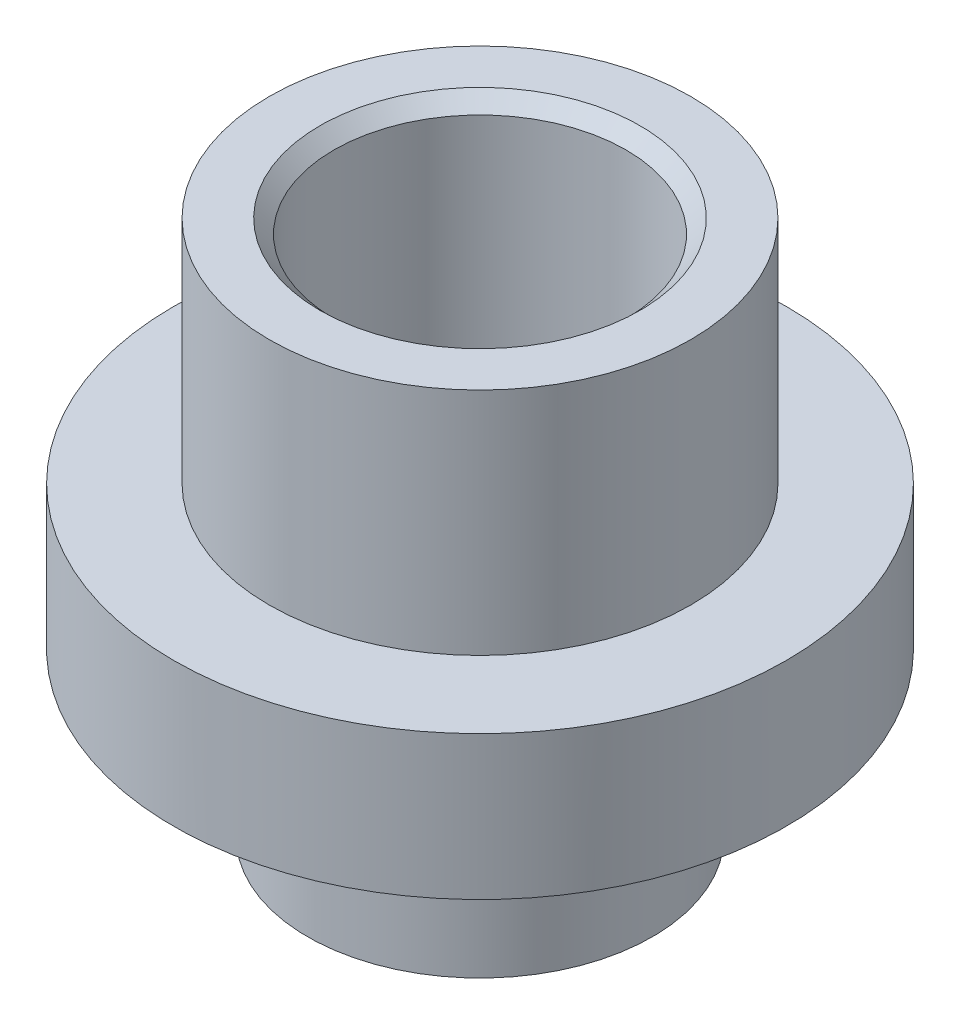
from build123d import *

# Parameters (mm, degrees)
SKICA1_R                 = 16
P_IDAT_VYSUNUT_M1_DEPTH  = 28
SKICA2_OUTSIDE_W         = 44.644
SKICA2_OUTSIDE_H         = 44.644
SKICA2_OUTSIDE_R         = 11
ODEBRAT_VYSUNUT_M1_DEPTH = 12
SKICA3_OUTSIDE_W         = 44.644
SKICA3_OUTSIDE_H         = 44.644
SKICA3_OUTSIDE_R         = 10.9
ODEBRAT_VYSUNUT_M2_DEPTH = 8.5
SKICA4_OUTSIDE_W         = 44.644
SKICA4_OUTSIDE_H         = 44.644
SKICA4_OUTSIDE_R         = 9
ODEBRAT_VYSUNUT_M3_DEPTH = 7
ZAOBLIT1_R               = 0.3
G3_8_Z_VIT1_D            = 15.25
G3_8_Z_VIT1_DEPTH        = 17.01
G3_8_Z_VIT1_CSINK_D      = 16.712
G3_8_Z_VIT1_CSINK_ANGLE  = 90
G3_8_Z_VIT1_TIP          = 4.402295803
SKICA7_R                 = 5
ODEBRAT_VYSUNUT_M4_DEPTH = 37


with BuildPart() as part:
    # Skica1 → P_idat vysunut_m1 (new body)
    with BuildSketch(Plane(origin=(0, 0, 0), x_dir=(1, 0, 0), z_dir=(0, 1, 0))):
        with Locations(Location((0, 0, 0), (0, 0, 270))):
            Circle(SKICA1_R)
    extrude(amount=P_IDAT_VYSUNUT_M1_DEPTH)

    # Skica2 outside → Odebrat vysunut_m1 (cut)
    with BuildSketch(Plane(origin=(0, 28, 0), x_dir=(1, 0, 0), z_dir=(0, 1, 0))):
        Rectangle(SKICA2_OUTSIDE_W, SKICA2_OUTSIDE_H)
        with Locations(Location((0, 0, 0), (0, 0, 270))):
            Circle(SKICA2_OUTSIDE_R, mode=Mode.SUBTRACT)
    extrude(amount=-ODEBRAT_VYSUNUT_M1_DEPTH, mode=Mode.SUBTRACT)

    # Skica3 outside → Odebrat vysunut_m2 (cut)
    with BuildSketch(Plane.XZ):
        Rectangle(SKICA3_OUTSIDE_W, SKICA3_OUTSIDE_H)
        with Locations(Location((0, 0, 0), (0, 0, 270))):
            Circle(SKICA3_OUTSIDE_R, mode=Mode.SUBTRACT)
    extrude(amount=-ODEBRAT_VYSUNUT_M2_DEPTH, mode=Mode.SUBTRACT)

    # Skica4 outside → Odebrat vysunut_m3 (cut)
    with BuildSketch(Plane.XZ):
        Rectangle(SKICA4_OUTSIDE_W, SKICA4_OUTSIDE_H)
        with Locations(Location((0, 0, 0), (0, 0, 270))):
            Circle(SKICA4_OUTSIDE_R, mode=Mode.SUBTRACT)
    extrude(amount=-ODEBRAT_VYSUNUT_M3_DEPTH, mode=Mode.SUBTRACT)

    # Zaoblit1
    zaoblit1_edges = [part.edges().sort_by_distance(p)[0] for p in [
        (0, 8.5, 10.9),
    ]]
    fillet(zaoblit1_edges, radius=ZAOBLIT1_R)

    # G3_8 z_vit1
    with Locations(Plane(origin=(0, 28, 0), x_dir=(-1, 0, 0), z_dir=(0, 1, 0))):
        with Locations((0, 0)):
            CounterSinkHole(G3_8_Z_VIT1_D / 2, G3_8_Z_VIT1_CSINK_D / 2, depth=G3_8_Z_VIT1_DEPTH, counter_sink_angle=G3_8_Z_VIT1_CSINK_ANGLE)
            with Locations((0, 0, -(G3_8_Z_VIT1_DEPTH + G3_8_Z_VIT1_TIP / 2))):  # 120° drill point
                Cone(0, G3_8_Z_VIT1_D / 2, G3_8_Z_VIT1_TIP, mode=Mode.SUBTRACT)

    # Skica7 → Odebrat vysunut_m4 (cut, through all)
    with BuildSketch(Plane.XZ):
        with Locations(Location((0, 0, 0), (0, 0, 270))):
            Circle(SKICA7_R)
    extrude(amount=-ODEBRAT_VYSUNUT_M4_DEPTH, mode=Mode.SUBTRACT)


solid = part.part
